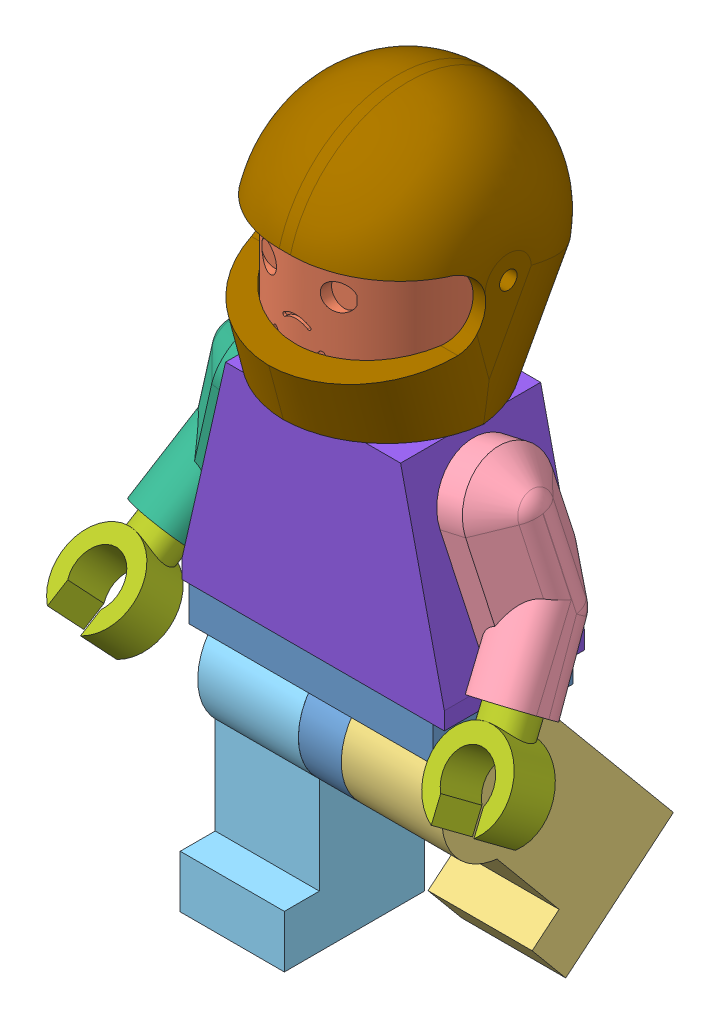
SolidWorks assembly Чоловічок.SLDASM, configuration У шоломі (file format 15000). Lengths in mm.
Overall size (26.03 42.31 18.42).
11 component instances, 10 part files, 21 mates.
Components (placement in the parent):
- Таз-1: Таз.SLDPRT [Default] at origin size (13.95 12.5 8)
- Голова-1: Голова.SLDPRT [Default] at (0 0 0) size (10 11.5 10.01)
- Кепка-1: Кепка.SLDPRT [Default] at (0.0519 0 0.3234) x (0.996884 0 -0.078878) z (0.078878 0 0.996884) (suppressed, hidden)
- Ліва нога-1: Ліва нога.SLDPRT [Default] at (0 2.2237 -7.1503) x (1 0 0) z (0 -0.639518 0.768776) size (5.95 14.5 8)
- Ліве плече-1: Ліве плече.SLDPRT [Default] at (-0.0452 0.1988 -3.5235) x (0.999368 0.002775 -0.035428) z (0.035428 -0.155882 0.98714) size (8.76 11.85 7.32)
- Права нога-1: Права нога.SLDPRT [Default] at origin size (5.95 14.5 8)
- Праве плече-1: Праве плече.SLDPRT [Default] at (0.0001 0 0) x (1 0.000004 0) z (0 0 1) size (8.76 11.85 7.32)
- Рука-1: Рука.SLDPRT [Default] at (-20.9175 3.23 -3.3123) x (0.950883 -0.216112 0.221623) z (-0.221623 0.02455 0.974823) size (5.33 9.12 9.1)
- Тулуб-1: Тулуб.SLDPRT [Default] at (0 0 0) size (15 17.6 8)
- Рука-2: Рука.SLDPRT [Default] at (-0.0452 0.1988 -3.5236) x (0.999368 0.002777 -0.035426) z (0.035426 -0.155883 0.98714) size (5.33 9.12 9.1)
- Шолом-1: Шолом.SLDPRT [Default] at (0 -0.5001 0) size (12.01 13.48 14.68)
Mates (geometry in assembly coordinates):
- Concentric1: concentric aligned: cylinder of Таз-1 through (0.285 20 -0.5) axis (0 -1 0) radius 2.1; cylinder of Тулуб-1 through (0.285 20 -0.5) axis (0 -1 0) radius 2.1
- Parallel1: parallel aligned: plane of Таз-1 through (-2.975 14 3.5) normal (0 0 1); plane of Тулуб-1 through (-3.38 16 3.505) normal (0 0 1)
- Coincident2: coincident anti-aligned: plane of Таз-1 through (10.975 16 -4.5) normal (0 1 0); plane of Тулуб-1 through (-3.38 16 -4.495) normal (0 -1 0)
- Concentric2: concentric aligned: cylinder of Праве плече-1 through (1.3184 24.1362 -0.495) axis (-0.975133 0.221621 0) radius 2; cylinder of Тулуб-1 through (1.3184 24.1362 -0.495) axis (-0.975133 0.221621 0) radius 2
- Coincident3: coincident anti-aligned: plane of Праве плече-1 through (1.3184 24.1362 -0.495) normal (0.975133 -0.221621 0); plane of Тулуб-1 through (1.3184 24.1362 -0.495) normal (-0.975133 0.221621 0)
- Concentric3: concentric aligned: cylinder of Ліве плече-1 through (6.9217 24.1362 -0.495) axis (0.975133 0.221621 0) radius 2; cylinder of Тулуб-1 through (6.9217 24.1362 -0.495) axis (0.975133 0.221621 0) radius 2
- Coincident4: coincident anti-aligned: plane of Ліве плече-1 through (6.9217 24.1362 -0.495) normal (-0.975133 -0.221621 0); plane of Тулуб-1 through (6.9217 24.1362 -0.495) normal (0.975133 0.221621 0)
- Coincident5: coincident anti-aligned: plane of Праве плече-1 through (-4.308 20.8127 -0.8112) normal (-0.15671 -0.689523 0.707107); plane of Рука-1 through (-4.308 20.8127 -0.8112) normal (0.15671 0.689523 -0.707107)
- Concentric5: concentric anti-aligned: cylinder of Праве плече-1 through (-4.308 20.8127 -0.8112) axis (-0.15671 -0.689523 0.707107) radius 1.1; cylinder of Рука-1 through (-5.0916 17.3651 2.7243) axis (0.15671 0.689523 -0.707107) radius 1.1
- Coincident6: coincident anti-aligned: plane of Ліве плече-1 through (12.5242 20.9183 -1.5245) normal (0.179746 -0.790881 0.584977); plane of Рука-2 through (12.5242 20.9183 -1.5245) normal (-0.179746 0.790881 -0.584977)
- Concentric6: concentric anti-aligned: cylinder of Ліве плече-1 through (12.5242 20.9183 -1.5245) axis (0.179746 -0.790881 0.584977) radius 1.1; cylinder of Рука-2 through (13.4229 16.9639 1.4004) axis (-0.179746 0.790881 -0.584977) radius 1.1
- Coincident8: coincident anti-aligned: plane of Таз-1 through (2.775 11 -0.5) normal (-1 0 0); plane of Права нога-1 through (2.775 11 -0.5) normal (1 0 0)
- Concentric7: concentric aligned: cylinder of Таз-1 through (-0.225 11 -0.5) axis (1 0 0) radius 1.25; cylinder of Права нога-1 through (-0.725 11 -0.5) axis (1 0 0) radius 1.25
- Coincident9: coincident anti-aligned: plane of Таз-1 through (5.225 11 -0.5) normal (1 0 0); plane of Ліва нога-1 through (5.225 11 -0.5) normal (-1 0 0)
- Concentric8: concentric aligned: cylinder of Таз-1 through (8.225 11 -0.5) axis (-1 0 0) radius 1.25; cylinder of Ліва нога-1 through (8.725 11 -0.5) axis (-1 0 0) radius 1.25
- Coincident10: coincident anti-aligned: plane of Голова-1 through (4.12 28 -0.495) normal (0 -1 0); plane of Тулуб-1 through (-0.88 28 -4.495) normal (0 1 0)
- Concentric10: concentric anti-aligned: cylinder of Голова-1 through (4.12 28 -0.495) axis (0 1 0) radius 2.4; cylinder of Тулуб-1 through (4.12 33.6 -0.495) axis (0 -1 0) radius 2.4
- Concentric11: concentric anti-aligned: cylinder of Голова-1 through (4.12 39.5 -0.495) axis (0 -1 0) radius 2.5; cylinder of Кепка-1 through (4.12 50.7698 -0.495) axis (0 1 0) radius 2
- Coincident14: coincident anti-aligned: plane of Голова-1 through (4.12 39.5 -0.495) normal (0 1 0); plane of Кепка-1 through (4.12 39.5 -0.495) normal (0 -1 0)
- Coincident15: coincident anti-aligned: plane of Голова-1 through (4.12 39.5 -0.495) normal (0 1 0); plane of Шолом-1 through (4.12 39.5 -0.495) normal (0 -1 0)
- Concentric13: concentric aligned: cylinder of Голова-1 through (4.12 39.5 -0.495) axis (0 -1 0) radius 2.5; cylinder of Шолом-1 through (4.12 39.5 -0.495) axis (0 -1 0) radius 2.5
